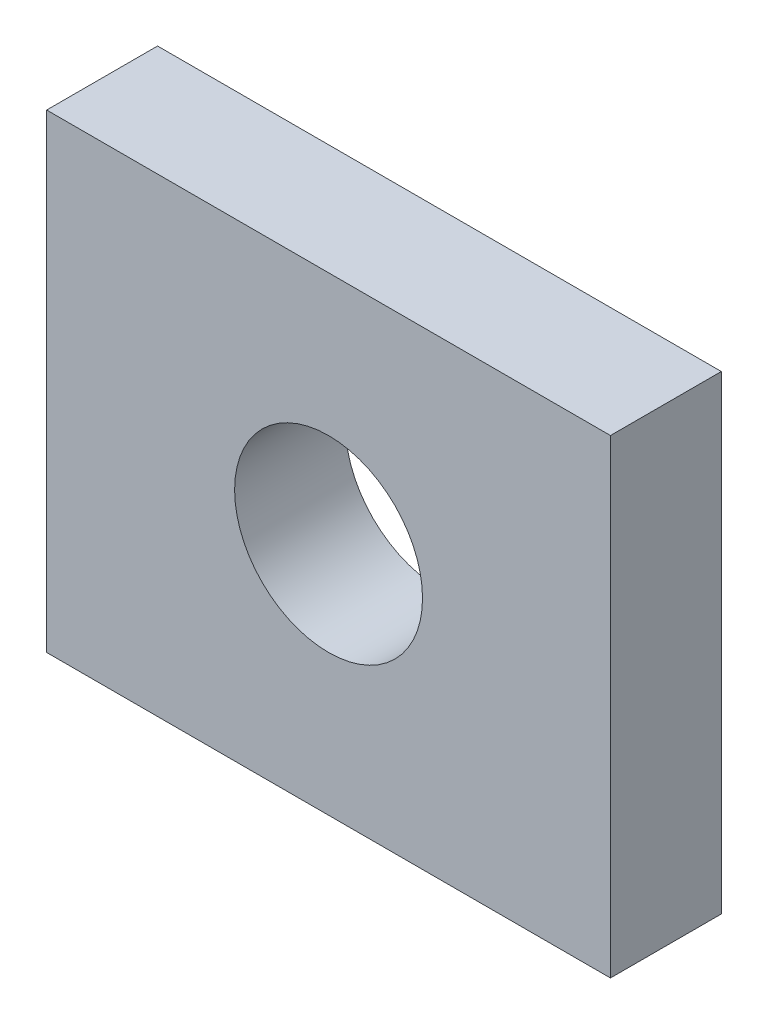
from build123d import *

# Parameters (mm, degrees)
SKETCH1_W           = 15.24
SKETCH1_H           = 12.7
SKETCH1_R           = 2.54
BOSS_EXTRUDE1_DEPTH = 2.9972


with BuildPart() as part:
    # Sketch1 → Boss-Extrude1 (new body)
    with BuildSketch(Plane.XY):
        with Locations((7.62, 6.35)):
            Rectangle(SKETCH1_W, SKETCH1_H)
        with Locations(Location((7.62, 6.35, 0), (0, 0, 180))):
            Circle(SKETCH1_R, mode=Mode.SUBTRACT)
    extrude(amount=BOSS_EXTRUDE1_DEPTH)


solid = part.part
